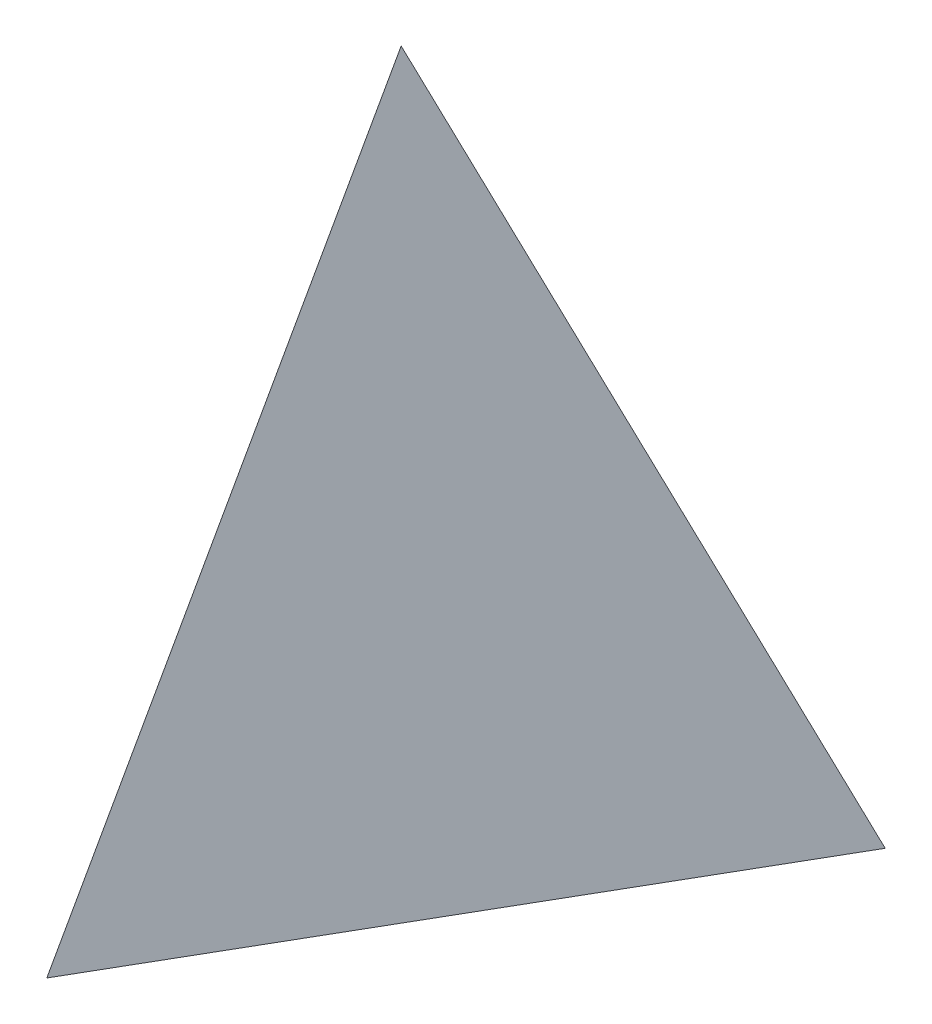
from build123d import *


with BuildPart() as part:
    # Sketch 1 → Loft 1 section 0
    with BuildSketch(Plane(origin=(0, 0, 0), x_dir=(1, 0, 0), z_dir=(0, 1, 0)), mode=Mode.PRIVATE) as loft_1_s0:
        with BuildLine():
            Line((0, -45), (38.97114317, 22.5))
            Line((38.97114317, 22.5), (-38.97114317, 22.5))
            Line((-38.97114317, 22.5), (0, -45))
        make_face()
    loft([Vertex(0, 80, 0), loft_1_s0.sketch])


solid = part.part
